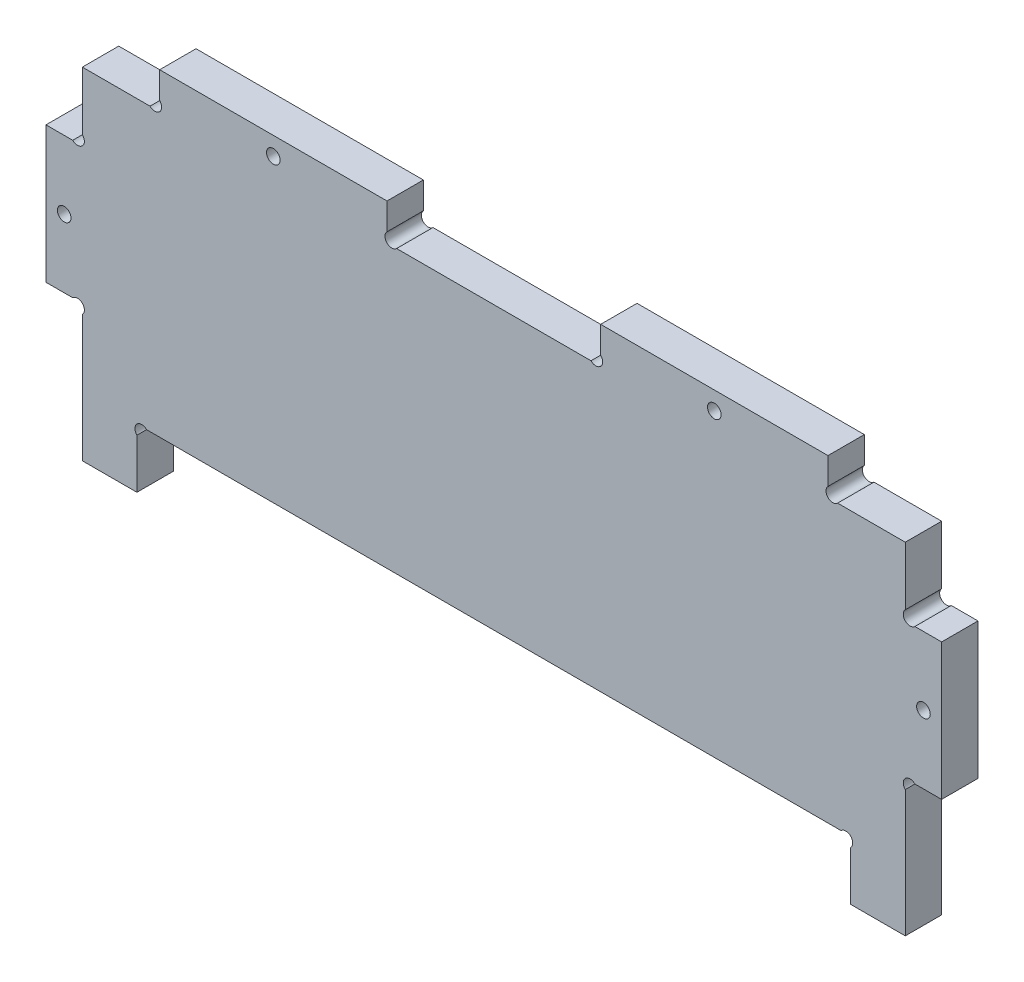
from build123d import *

# Parameters (mm, degrees)
ESQUISSE1_R        = 1.5
BOSS_EXTRU_1_DEPTH = 8


with BuildPart() as part:
    # Esquisse1 → Boss.-Extru.1 (new body)
    with BuildSketch(Plane.XY):
        with BuildLine():
            Line((-21.043081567, -36.536710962), (24.71427775, -36.536710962))
            Line((24.71427775, -36.536710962), (131.714277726, -36.536710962))
            ThreePointArc((131.714277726, -36.536710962), (133.835598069, -36.536710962), (133.835598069, -38.658031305))
            Line((133.835598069, -38.658031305), (133.835598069, -49.536710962))
            Line((133.835598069, -49.536710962), (145.835598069, -49.536710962))
            Line((145.835598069, -49.536710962), (145.835598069, -36.536710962))
            Line((145.835598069, -36.536710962), (145.835598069, -22.097371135))
            Line((145.835598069, -22.097371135), (145.835598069, -21.658031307))
            ThreePointArc((145.835598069, -21.658031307), (145.835598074, -19.536710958), (147.956918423, -19.536710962))
            Line((147.956918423, -19.536710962), (153.835598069, -19.536710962))
            Line((153.835598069, -19.536710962), (153.835598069, 10.463289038))
            Line((153.835598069, 10.463289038), (147.956918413, 10.463289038))
            ThreePointArc((147.956918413, 10.463289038), (145.83559807, 10.463289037), (145.835598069, 12.58460938))
            Line((145.835598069, 12.58460938), (145.835598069, 13.023949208))
            Line((145.835598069, 13.023949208), (145.835598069, 25.463289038))
            Line((145.835598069, 25.463289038), (130.956918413, 25.463289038))
            ThreePointArc((130.956918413, 25.463289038), (128.835598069, 25.463289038), (128.835598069, 27.584609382))
            Line((128.835598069, 27.584609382), (128.835598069, 33.463289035))
            Line((128.835598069, 33.463289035), (78.835598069, 33.463289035))
            Line((78.835598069, 33.463289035), (78.835598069, 27.584609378))
            ThreePointArc((78.835598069, 27.584609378), (78.835598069, 25.463289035), (76.714277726, 25.463289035))
            Line((76.714277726, 25.463289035), (33.956918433, 25.463289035))
            ThreePointArc((33.956918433, 25.463289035), (31.83559809, 25.463289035), (31.83559809, 27.584609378))
            Line((31.83559809, 27.584609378), (31.83559809, 33.463289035))
            Line((31.83559809, 33.463289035), (-18.16440191, 33.463289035))
            Line((-18.16440191, 33.463289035), (-18.16440191, 27.584609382))
            ThreePointArc((-18.16440191, 27.584609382), (-18.16440191, 25.463289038), (-20.285722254, 25.463289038))
            Line((-20.285722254, 25.463289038), (-35.16440191, 25.463289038))
            Line((-35.16440191, 25.463289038), (-35.16440191, 13.023949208))
            Line((-35.16440191, 13.023949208), (-35.16440191, 12.58460938))
            ThreePointArc((-35.16440191, 12.58460938), (-35.164401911, 10.463289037), (-37.285722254, 10.463289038))
            Line((-37.285722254, 10.463289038), (-43.16440191, 10.463289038))
            Line((-43.16440191, 10.463289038), (-43.16440191, -19.536710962))
            Line((-43.16440191, -19.536710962), (-37.285722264, -19.536710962))
            ThreePointArc((-37.285722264, -19.536710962), (-35.164401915, -19.536710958), (-35.16440191, -21.658031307))
            Line((-35.16440191, -21.658031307), (-35.16440191, -22.097371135))
            Line((-35.16440191, -22.097371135), (-35.16440191, -36.536710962))
            Line((-35.16440191, -36.536710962), (-35.16440191, -49.536710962))
            Line((-35.16440191, -49.536710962), (-23.16440191, -49.536710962))
            Line((-23.16440191, -49.536710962), (-23.16440191, -38.658031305))
            ThreePointArc((-23.16440191, -38.658031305), (-23.16440191, -36.536710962), (-21.043081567, -36.536710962))
        make_face()
        with Locations(Location((-39.16440191, -4.536710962, 0), (0, 0, 180))):
            Circle(ESQUISSE1_R, mode=Mode.SUBTRACT)
        with Locations(Location((6.835598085, 29.463289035, 0), (0, 0, 180))):
            Circle(ESQUISSE1_R, mode=Mode.SUBTRACT)
        with Locations((103.835598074, 29.463289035)):
            Circle(ESQUISSE1_R, mode=Mode.SUBTRACT)
        with Locations((149.835598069, -4.536710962)):
            Circle(ESQUISSE1_R, mode=Mode.SUBTRACT)
    extrude(amount=BOSS_EXTRU_1_DEPTH)


solid = part.part
